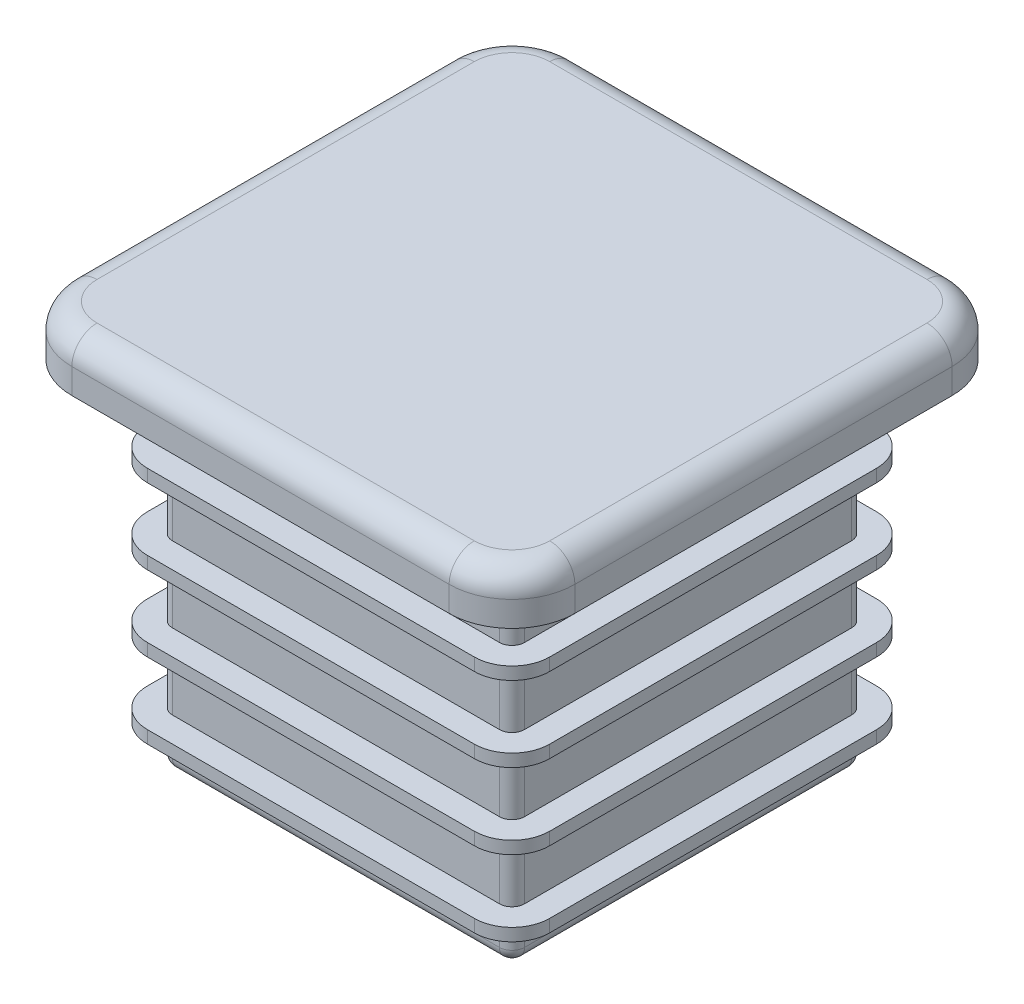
from build123d import *

# Parameters (mm, degrees)
BOSS_EXTRU_1_DEPTH         = 2
CONG_1_R                   = 1
ESQUISSE2_W                = 14
ESQUISSE2_H                = 14
ESQUISSE2_W_2              = 11
ESQUISSE2_H_2              = 11
EXTRU_MINCE1_DEPTH         = 14
CONG_2_R                   = 0.5
CONG_3_R                   = 0.5
BOSS_EXTRU_2_START         = 0.5
BOSS_EXTRU_2_DEPTH         = 0.5
R_P_TITION_LIN_AIRE1_COUNT = 4
R_P_TITION_LIN_AIRE1_PITCH = 3


with BuildPart() as part:
    # Esquisse1 → Boss.-Extru.1 (new body)
    with BuildSketch(Plane(origin=(0, 0, 0), x_dir=(1, 0, 0), z_dir=(0, 1, 0))):
        with BuildLine():
            Line((-7.5, 10), (7.5, 10))
            ThreePointArc((7.5, 10), (9.267766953, 9.267766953), (10, 7.5))
            Line((10, 7.5), (10, -7.5))
            ThreePointArc((10, -7.5), (9.267766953, -9.267766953), (7.5, -10))
            Line((7.5, -10), (-7.5, -10))
            ThreePointArc((-7.5, -10), (-9.267766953, -9.267766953), (-10, -7.5))
            Line((-10, -7.5), (-10, 7.5))
            ThreePointArc((-10, 7.5), (-9.267766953, 9.267766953), (-7.5, 10))
        make_face()
    extrude(amount=BOSS_EXTRU_1_DEPTH)

    # Cong_1
    cong_1_edges = [part.edges().sort_by_distance(p)[0] for p in [
        (9.267766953, 2, 9.267766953),
        (10, 2, 0),
        (9.267766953, 2, -9.267766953),
        (0, 2, -10),
        (-9.267766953, 2, -9.267766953),
        (-10, 2, 0),
        (-9.267766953, 2, 9.267766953),
        (0, 2, 10),
    ]]
    fillet(cong_1_edges, radius=CONG_1_R)

    # Esquisse2 → Extru.-Mince1 (add)
    with BuildSketch(Plane.XZ):
        Rectangle(ESQUISSE2_W, ESQUISSE2_H)
        Rectangle(ESQUISSE2_W_2, ESQUISSE2_H_2, mode=Mode.SUBTRACT)
    extrude(amount=EXTRU_MINCE1_DEPTH)

    # Cong_2
    cong_2_edges = [part.edges().sort_by_distance(p)[0] for p in [
        (7, -7, -7),
        (7, -7, 7),
        (-7, -7, 7),
        (-7, -7, -7),
    ]]
    fillet(cong_2_edges, radius=CONG_2_R)

    # Cong_3
    cong_3_edges = [part.edges().sort_by_distance(p)[0] for p in [
        (-7, -14, 0),
        (0, -14, 7),
        (7, -14, 0),
        (0, -14, -7),
        (6.853553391, -14, -6.853553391),
        (6.853553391, -14, 6.853553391),
        (-6.853553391, -14, -6.853553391),
        (-6.853553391, -14, 6.853553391),
    ]]
    fillet(cong_3_edges, radius=CONG_3_R)

    # Esquisse3 → Boss.-Extru.2 (add)
    with BuildSketch(Plane(origin=(0, -3, 0), x_dir=(-1, 0, 0), z_dir=(0, -1, 0)).offset(BOSS_EXTRU_2_START)):
        with BuildLine():
            Line((8, -6.5), (8, 6.5))
            ThreePointArc((8, 6.5), (7.560660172, 7.560660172), (6.5, 8))
            Line((6.5, 8), (-6.5, 8))
            ThreePointArc((-6.5, 8), (-7.560660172, 7.560660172), (-8, 6.5))
            Line((-8, 6.5), (-8, -6.5))
            ThreePointArc((-8, -6.5), (-7.560660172, -7.560660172), (-6.5, -8))
            Line((-6.5, -8), (6.5, -8))
            ThreePointArc((6.5, -8), (7.560660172, -7.560660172), (8, -6.5))
        make_face()
        with BuildLine():
            Line((7, -6.5), (7, 6.5))
            ThreePointArc((7, 6.5), (6.853553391, 6.853553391), (6.5, 7))
            Line((6.5, 7), (-6.5, 7))
            ThreePointArc((-6.5, 7), (-6.853553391, 6.853553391), (-7, 6.5))
            Line((-7, 6.5), (-7, -6.5))
            ThreePointArc((-7, -6.5), (-6.853553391, -6.853553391), (-6.5, -7))
            Line((-6.5, -7), (6.5, -7))
            ThreePointArc((6.5, -7), (6.853553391, -6.853553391), (7, -6.5))
        make_face(mode=Mode.SUBTRACT)
    boss_extru_2 = extrude(amount=-BOSS_EXTRU_2_DEPTH)

    # R_p_tition lin_aire1: Boss.-Extru.2 ×4
    with Locations(*[(0, -i * R_P_TITION_LIN_AIRE1_PITCH, 0) for i in range(1, R_P_TITION_LIN_AIRE1_COUNT)]):
        add(boss_extru_2)


solid = part.part
